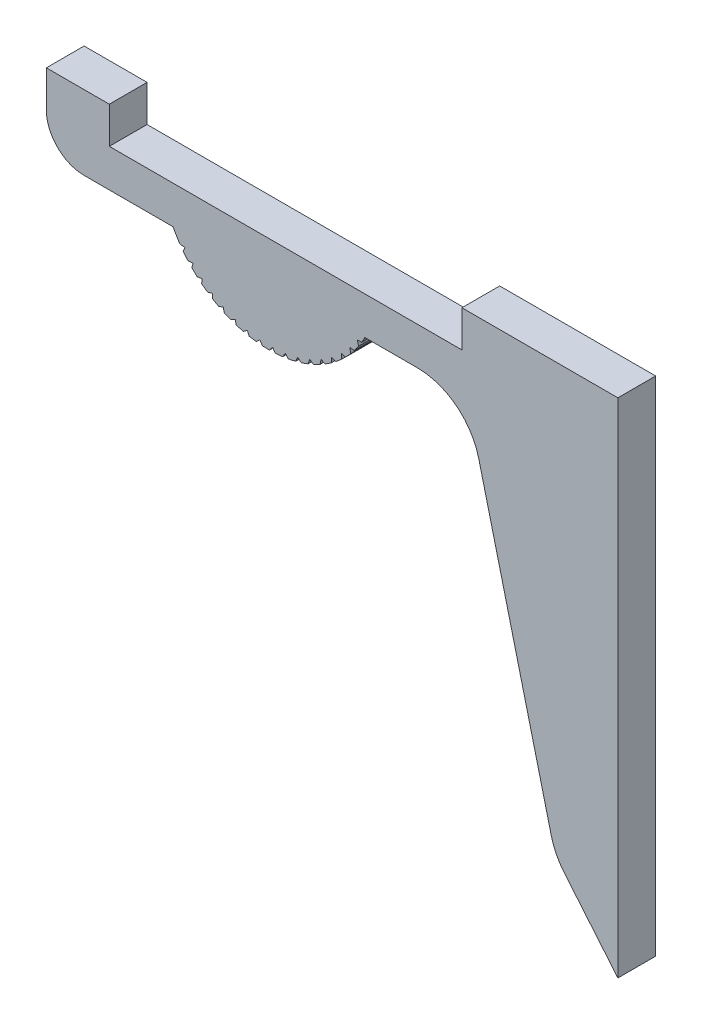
from build123d import *

# Parameters (mm, degrees)
BOSS_EXTRU_1_DEPTH      = 3
ESQUISSE2_W             = 28
ESQUISSE2_H             = 3
ENL_V_MAT_EXTRU_1_DEPTH = 3
ESQUISSE3_W             = 45.384651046
ESQUISSE3_H             = 0.1
ENL_V_MAT_EXTRU_2_DEPTH = 10
CONG_1_R                = 3
CONG_2_R                = 5
BOSS_EXTRU_2_DEPTH      = 3


with BuildPart() as part:
    # Esquisse1 → Boss.-Extru.1 (new body)
    with BuildSketch(Plane.XY):
        Polygon((0, -40), (0, 0), (-45.384651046, 0), (-45.384651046, -6), (-12, -6), (-5, -34), align=None)
    extrude(amount=-BOSS_EXTRU_1_DEPTH)

    # Esquisse2 → Enl_v. mat.-Extru.1 (cut)
    with BuildSketch(Plane(origin=(0, 0, -3), x_dir=(-1, 0, 0), z_dir=(0, 0, -1))):
        with Locations((26.384651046, -1.5)):
            Rectangle(ESQUISSE2_W, ESQUISSE2_H)
    extrude(amount=-ENL_V_MAT_EXTRU_1_DEPTH, mode=Mode.SUBTRACT)

    # Esquisse3 → Enl_v. mat.-Extru.2 (cut)
    with BuildSketch(Plane.XY):
        with Locations((-22.692325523, -0.05)):
            Rectangle(ESQUISSE3_W, ESQUISSE3_H)
    extrude(amount=-ENL_V_MAT_EXTRU_2_DEPTH, mode=Mode.SUBTRACT)

    # Cong_1
    cong_1_edges = [part.edges().sort_by_distance(p)[0] for p in [
        (-45.384651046, -6, -1.5),
    ]]
    fillet(cong_1_edges, radius=CONG_1_R)

    # Cong_2
    cong_2_edges = [part.edges().sort_by_distance(p)[0] for p in [
        (-5, -34, -1.5),
        (-12, -6, -1.5),
    ]]
    fillet(cong_2_edges, radius=CONG_2_R)

    # Esquisse4 → Boss.-Extru.2 (add)
    with BuildSketch(Plane.XY.offset(-3)):
        with BuildLine():
            Line((-35.321952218, -6), (-20.090316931, -6))
            ThreePointArc((-20.090316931, -6), (-20.213045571, -6.230254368), (-20.342733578, -6.456661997))
            Line((-20.342733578, -6.456661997), (-20.700829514, -6.456661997))
            Line((-20.700829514, -6.456661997), (-20.583086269, -6.838520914))
            ThreePointArc((-20.583086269, -6.838520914), (-20.752331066, -7.083010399), (-20.929963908, -7.321475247))
            Line((-20.929963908, -7.321475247), (-21.285390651, -7.277834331))
            Line((-21.285390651, -7.277834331), (-21.215061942, -7.671196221))
            ThreePointArc((-21.215061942, -7.671196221), (-21.412840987, -7.893237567), (-21.618211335, -8.108276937))
            Line((-21.618211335, -8.108276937), (-21.965670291, -8.021645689))
            Line((-21.965670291, -8.021645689), (-21.943804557, -8.420646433))
            ThreePointArc((-21.943804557, -8.420646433), (-22.167169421, -8.616929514), (-22.397215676, -8.805337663))
            Line((-22.397215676, -8.805337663), (-22.731527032, -8.677007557))
            Line((-22.731527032, -8.677007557), (-22.758450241, -9.075698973))
            ThreePointArc((-22.758450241, -9.075698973), (-23.004071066, -9.24329766), (-23.255363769, -9.402265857))
            Line((-23.255363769, -9.402265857), (-23.571543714, -9.234149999))
            Line((-23.571543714, -9.234149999), (-23.646854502, -9.626588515))
            ThreePointArc((-23.646854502, -9.626588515), (-23.911069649, -9.763004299), (-24.179862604, -9.890162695))
            Line((-24.179862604, -9.890162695), (-24.473197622, -9.684767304))
            Line((-24.473197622, -9.684767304), (-24.595773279, -10.065102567))
            ThreePointArc((-24.595773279, -10.065102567), (-24.874643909, -10.168301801), (-25.156930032, -10.261754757))
            Line((-25.156930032, -10.261754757), (-25.423047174, -10.022141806))
            Line((-25.423047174, -10.022141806), (-25.591060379, -10.384703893))
            ThreePointArc((-25.591060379, -10.384703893), (-25.880429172, -10.453148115), (-26.172000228, -10.511502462))
            Line((-26.172000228, -10.511502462), (-26.4069323, -10.241244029))
            Line((-26.4069323, -10.241244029), (-26.617878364, -10.580627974))
            ThreePointArc((-26.617878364, -10.580627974), (-26.913431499, -10.613296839), (-27.209940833, -10.635682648))
            Line((-27.209940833, -10.635682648), (-27.41018554, -10.338807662))
            Line((-27.41018554, -10.338807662), (-27.660919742, -10.649954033))
            ThreePointArc((-27.660919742, -10.649954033), (-27.958251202, -10.646360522), (-28.255278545, -10.632444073))
            Line((-28.255278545, -10.632444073), (-28.417850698, -10.313378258))
            Line((-28.417850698, -10.313378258), (-28.704635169, -10.591648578))
            ThreePointArc((-28.704635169, -10.591648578), (-28.999312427, -10.551846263), (-29.292429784, -10.501835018))
            Line((-29.292429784, -10.501835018), (-29.414905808, -10.165334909))
            Line((-29.414905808, -10.165334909), (-29.733465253, -10.406580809))
            ThreePointArc((-29.733465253, -10.406580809), (-30.021095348, -10.331163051), (-30.305933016, -10.245802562))
            Line((-30.305933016, -10.245802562), (-30.386487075, -9.896884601))
            Line((-30.386487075, -9.896884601), (-30.732072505, -10.09750966))
            ThreePointArc((-30.732072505, -10.09750966), (-31.008367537, -9.987600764), (-31.280679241, -9.868163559))
            Line((-31.280679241, -9.868163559), (-31.318110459, -9.51202931))
            Line((-31.318110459, -9.51202931), (-31.685569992, -9.669042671))
            ThreePointArc((-31.685569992, -9.669042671), (-31.946411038, -9.526281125), (-32.202137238, -9.374547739))
            Line((-32.202137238, -9.374547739), (-32.195887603, -9.016506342))
            Line((-32.195887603, -9.016506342), (-32.579743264, -9.127567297))
            ThreePointArc((-32.579743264, -9.127567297), (-32.821241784, -8.954081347), (-33.056570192, -8.772313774))
            Line((-33.056570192, -8.772313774), (-33.00673287, -8.417702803))
            Line((-33.00673287, -8.417702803), (-33.401262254, -8.481155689))
            ThreePointArc((-33.401262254, -8.481155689), (-33.619818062, -8.279531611), (-33.831240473, -8.070439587))
            Line((-33.831240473, -8.070439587), (-33.738558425, -7.724545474))
            Line((-33.738558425, -7.724545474), (-34.137880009, -7.739444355))
            ThreePointArc((-34.137880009, -7.739444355), (-34.330234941, -7.512687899), (-34.514599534, -7.279388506))
            Line((-34.514599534, -7.279388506), (-34.380454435, -6.947367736))
            Line((-34.380454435, -6.947367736), (-34.778615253, -6.913490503))
            ThreePointArc((-34.778615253, -6.913490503), (-35.064472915, -6.465184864), (-35.321952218, -6))
        make_face()
    extrude(amount=BOSS_EXTRU_2_DEPTH)


solid = part.part
